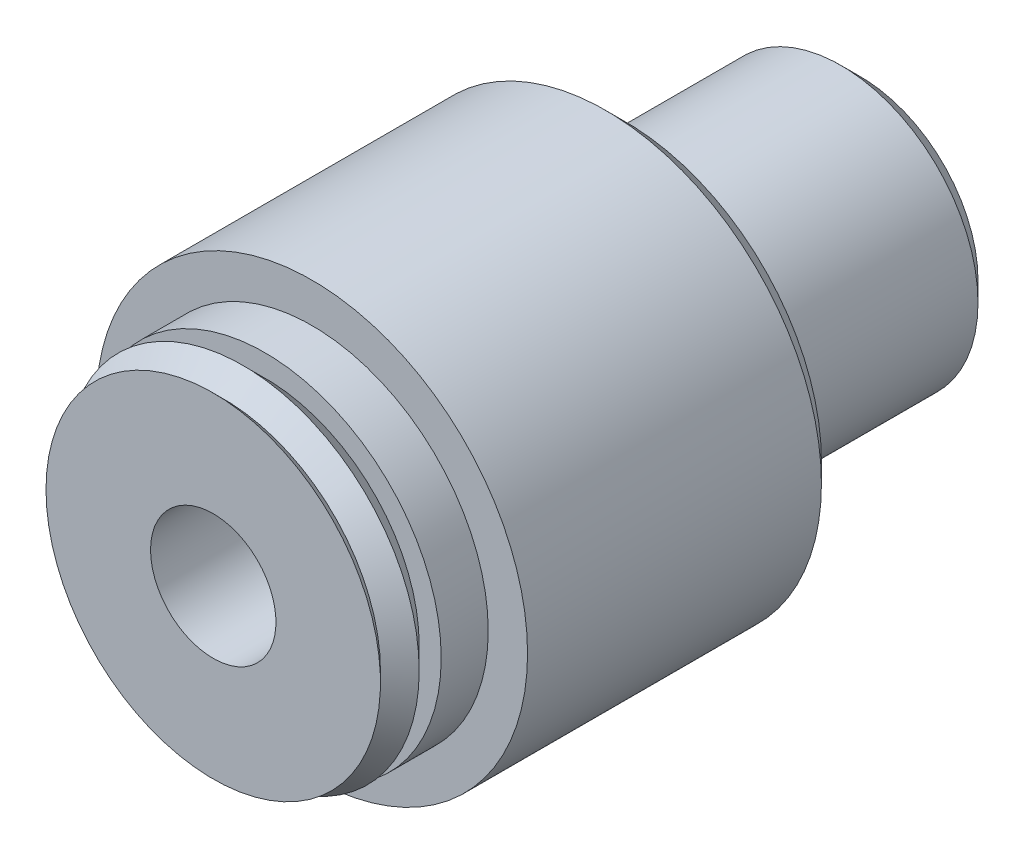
ISO-10303-21;
HEADER;
FILE_DESCRIPTION(('STEP AP214'),'2;1');
FILE_NAME('part.step','',(''),(''),'','','');
FILE_SCHEMA(('AUTOMOTIVE_DESIGN { 1 0 10303 214 1 1 1 1 }'));
ENDSEC;
DATA;
#1=APPLICATION_CONTEXT('core data for automotive mechanical design processes');
#2=APPLICATION_PROTOCOL_DEFINITION('international standard','automotive_design',2000,#1);
#3=PRODUCT_CONTEXT('',#1,'mechanical');
#4=PRODUCT('Part','Part','',(#3));
#5=PRODUCT_RELATED_PRODUCT_CATEGORY('part','',(#4));
#6=PRODUCT_DEFINITION_FORMATION('','',#4);
#7=PRODUCT_DEFINITION_CONTEXT('part definition',#1,'design');
#8=PRODUCT_DEFINITION('design','',#6,#7);
#9=PRODUCT_DEFINITION_SHAPE('','',#8);
#10=(LENGTH_UNIT() NAMED_UNIT(*) SI_UNIT(.MILLI.,.METRE.));
#11=(NAMED_UNIT(*) PLANE_ANGLE_UNIT() SI_UNIT($,.RADIAN.));
#12=(NAMED_UNIT(*) SI_UNIT($,.STERADIAN.) SOLID_ANGLE_UNIT());
#13=UNCERTAINTY_MEASURE_WITH_UNIT(LENGTH_MEASURE(1.E-05),#10,'distance_accuracy_value','');
#14=(GEOMETRIC_REPRESENTATION_CONTEXT(3) GLOBAL_UNCERTAINTY_ASSIGNED_CONTEXT((#13)) GLOBAL_UNIT_ASSIGNED_CONTEXT((#10,
#11,#12)) REPRESENTATION_CONTEXT('',''));
#15=CARTESIAN_POINT('',(0.,0.,0.));
#16=DIRECTION('',(0.,0.,1.));
#17=DIRECTION('',(1.,0.,0.));
#18=AXIS2_PLACEMENT_3D('',#15,#16,#17);
#19=CARTESIAN_POINT('',(0.,0.,0.));
#20=DIRECTION('',(0.,0.,1.));
#21=DIRECTION('',(1.,0.,0.));
#22=AXIS2_PLACEMENT_3D('',#19,#20,#21);
#23=PLANE('',#22);
#24=CARTESIAN_POINT('',(0.,0.,0.));
#25=DIRECTION('',(0.,0.,-1.));
#26=DIRECTION('',(-1.,0.,0.));
#27=AXIS2_PLACEMENT_3D('',#24,#25,#26);
#28=CIRCLE('',#27,6.77545);
#29=CARTESIAN_POINT('',(-6.77545,0.,0.));
#30=VERTEX_POINT('',#29);
#31=EDGE_CURVE('E115',#30,#30,#28,.T.);
#32=ORIENTED_EDGE('',*,*,#31,.F.);
#33=EDGE_LOOP('',(#32));
#34=FACE_BOUND('',#33,.T.);
#35=CARTESIAN_POINT('',(0.,0.,0.));
#36=DIRECTION('',(0.,0.,-1.));
#37=DIRECTION('',(-1.,0.,0.));
#38=AXIS2_PLACEMENT_3D('',#35,#36,#37);
#39=CIRCLE('',#38,2.54);
#40=CARTESIAN_POINT('',(-2.54,0.,0.));
#41=VERTEX_POINT('',#40);
#42=EDGE_CURVE('E126',#41,#41,#39,.T.);
#43=ORIENTED_EDGE('',*,*,#42,.T.);
#44=EDGE_LOOP('',(#43));
#45=FACE_BOUND('',#44,.T.);
#46=ADVANCED_FACE('F30',(#34,#45),#23,.T.);
#47=CARTESIAN_POINT('',(0.,0.,-26.223214));
#48=DIRECTION('',(0.,0.,-1.));
#49=DIRECTION('',(-1.,0.,0.));
#50=AXIS2_PLACEMENT_3D('',#47,#48,#49);
#51=PLANE('',#50);
#52=CARTESIAN_POINT('',(0.,0.,-26.223214));
#53=DIRECTION('',(0.,0.,-1.));
#54=DIRECTION('',(-1.,0.,0.));
#55=AXIS2_PLACEMENT_3D('',#52,#53,#54);
#56=CIRCLE('',#55,4.7625);
#57=CARTESIAN_POINT('',(4.7625,0.,-26.223214));
#58=VERTEX_POINT('',#57);
#59=EDGE_CURVE('E47',#58,#58,#56,.T.);
#60=ORIENTED_EDGE('',*,*,#59,.T.);
#61=EDGE_LOOP('',(#60));
#62=FACE_BOUND('',#61,.T.);
#63=CARTESIAN_POINT('',(0.,0.,-26.223214));
#64=DIRECTION('',(0.,0.,-1.));
#65=DIRECTION('',(-1.,0.,0.));
#66=AXIS2_PLACEMENT_3D('',#63,#64,#65);
#67=CIRCLE('',#66,2.54);
#68=CARTESIAN_POINT('',(-2.54,0.,-26.223214));
#69=VERTEX_POINT('',#68);
#70=EDGE_CURVE('E124',#69,#69,#67,.T.);
#71=ORIENTED_EDGE('',*,*,#70,.F.);
#72=EDGE_LOOP('',(#71));
#73=FACE_BOUND('',#72,.T.);
#74=ADVANCED_FACE('F63',(#62,#73),#51,.T.);
#75=CARTESIAN_POINT('',(-8.7376,0.,-7.173214));
#76=DIRECTION('',(1.,0.,0.));
#77=DIRECTION('',(0.,0.,-1.));
#78=AXIS2_PLACEMENT_3D('',#75,#76,#77);
#79=CYLINDRICAL_SURFACE('',#78,2.032);
#80=CARTESIAN_POINT('',(-8.7376,0.,-9.205214));
#81=CARTESIAN_POINT('',(-8.73759797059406,-0.11251614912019,-9.20521042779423));
#82=CARTESIAN_POINT('',(-8.7354047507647,-0.225074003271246,-9.1958371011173));
#83=CARTESIAN_POINT('',(-8.72686767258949,-0.446980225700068,-9.15863769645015));
#84=CARTESIAN_POINT('',(-8.72052111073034,-0.556326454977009,-9.13079959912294));
#85=CARTESIAN_POINT('',(-8.70438234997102,-0.768571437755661,-9.05759945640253));
#86=CARTESIAN_POINT('',(-8.6945939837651,-0.871477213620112,-9.0122568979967));
#87=CARTESIAN_POINT('',(-8.67262205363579,-1.06821919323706,-8.90539972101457));
#88=CARTESIAN_POINT('',(-8.66043848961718,-1.16205539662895,-8.84388510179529));
#89=CARTESIAN_POINT('',(-8.63476052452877,-1.33968569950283,-8.7052590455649));
#90=CARTESIAN_POINT('',(-8.62124813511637,-1.42329320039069,-8.62791182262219));
#91=CARTESIAN_POINT('',(-8.59455904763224,-1.57647313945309,-8.46032176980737));
#92=CARTESIAN_POINT('',(-8.58138238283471,-1.64604419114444,-8.37007766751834));
#93=CARTESIAN_POINT('',(-8.55667768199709,-1.7700227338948,-8.17784635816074));
#94=CARTESIAN_POINT('',(-8.54517260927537,-1.82422727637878,-8.07572504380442));
#95=CARTESIAN_POINT('',(-8.52537378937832,-1.91463093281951,-7.86351031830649));
#96=CARTESIAN_POINT('',(-8.51707960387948,-1.9508325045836,-7.75341799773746));
#97=CARTESIAN_POINT('',(-8.50482562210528,-2.00357737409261,-7.53042272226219));
#98=CARTESIAN_POINT('',(-8.50079258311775,-2.02045329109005,-7.4176025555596));
#99=CARTESIAN_POINT('',(-8.4972978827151,-2.03510284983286,-7.19066583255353));
#100=CARTESIAN_POINT('',(-8.49783558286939,-2.03287915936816,-7.07654945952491));
#101=CARTESIAN_POINT('',(-8.50335549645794,-2.00965931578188,-6.85276454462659));
#102=CARTESIAN_POINT('',(-8.50824523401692,-1.9890537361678,-6.74305284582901));
#103=CARTESIAN_POINT('',(-8.52177157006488,-1.93027563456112,-6.52868762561));
#104=CARTESIAN_POINT('',(-8.53040840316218,-1.89210201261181,-6.42403442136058));
#105=CARTESIAN_POINT('',(-8.55054421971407,-1.79892392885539,-6.22168063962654));
#106=CARTESIAN_POINT('',(-8.56206795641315,-1.7437729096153,-6.12405011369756));
#107=CARTESIAN_POINT('',(-8.5866644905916,-1.61830836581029,-5.93928667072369));
#108=CARTESIAN_POINT('',(-8.59973752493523,-1.54799252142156,-5.85215536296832));
#109=CARTESIAN_POINT('',(-8.62635329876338,-1.39214573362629,-5.68861933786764));
#110=CARTESIAN_POINT('',(-8.63989969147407,-1.30628371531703,-5.61253037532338));
#111=CARTESIAN_POINT('',(-8.66564488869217,-1.12286054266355,-5.47577636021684));
#112=CARTESIAN_POINT('',(-8.67784366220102,-1.02529911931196,-5.41511166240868));
#113=CARTESIAN_POINT('',(-8.69956723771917,-0.820833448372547,-5.3108342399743));
#114=CARTESIAN_POINT('',(-8.70908487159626,-0.713905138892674,-5.26726710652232));
#115=CARTESIAN_POINT('',(-8.72432110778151,-0.493973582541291,-5.19880975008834));
#116=CARTESIAN_POINT('',(-8.73004033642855,-0.380971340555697,-5.17391644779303));
#117=CARTESIAN_POINT('',(-8.73694469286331,-0.15480428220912,-5.14398241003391));
#118=CARTESIAN_POINT('',(-8.73822817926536,-0.0416993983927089,-5.13851093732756));
#119=CARTESIAN_POINT('',(-8.73639399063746,0.183808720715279,-5.14640245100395));
#120=CARTESIAN_POINT('',(-8.73327665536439,0.296212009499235,-5.15976398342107));
#121=CARTESIAN_POINT('',(-8.72305358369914,0.515669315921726,-5.20458583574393));
#122=CARTESIAN_POINT('',(-8.71599851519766,0.622772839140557,-5.23581635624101));
#123=CARTESIAN_POINT('',(-8.69869154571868,0.830218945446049,-5.31523144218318));
#124=CARTESIAN_POINT('',(-8.68843934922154,0.930560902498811,-5.36341757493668));
#125=CARTESIAN_POINT('',(-8.66563542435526,1.123388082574,-5.47624658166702));
#126=CARTESIAN_POINT('',(-8.65304991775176,1.21572409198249,-5.54113748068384));
#127=CARTESIAN_POINT('',(-8.62703722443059,1.3883502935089,-5.68521157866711));
#128=CARTESIAN_POINT('',(-8.61360991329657,1.46863869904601,-5.76439689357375));
#129=CARTESIAN_POINT('',(-8.58708097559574,1.61662481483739,-5.93679944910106));
#130=CARTESIAN_POINT('',(-8.57399212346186,1.68402246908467,-6.03027660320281));
#131=CARTESIAN_POINT('',(-8.54994125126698,1.8021675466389,-6.22747354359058));
#132=CARTESIAN_POINT('',(-8.53897913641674,1.85291571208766,-6.33119287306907));
#133=CARTESIAN_POINT('',(-8.52053551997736,1.93595940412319,-6.54536375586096));
#134=CARTESIAN_POINT('',(-8.51303376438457,1.96836256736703,-6.6557717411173));
#135=CARTESIAN_POINT('',(-8.5023300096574,2.01410032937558,-6.88066534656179));
#136=CARTESIAN_POINT('',(-8.49912721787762,2.02743844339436,-6.99515021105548));
#137=CARTESIAN_POINT('',(-8.49743852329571,2.03450298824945,-7.22191105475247));
#138=CARTESIAN_POINT('',(-8.49883782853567,2.02870668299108,-7.33417156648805));
#139=CARTESIAN_POINT('',(-8.50593357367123,1.99874469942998,-7.55606831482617));
#140=CARTESIAN_POINT('',(-8.51162994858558,1.97457929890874,-7.66570459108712));
#141=CARTESIAN_POINT('',(-8.52661852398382,1.90880893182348,-7.87880189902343));
#142=CARTESIAN_POINT('',(-8.53589461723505,1.86728201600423,-7.98228822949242));
#143=CARTESIAN_POINT('',(-8.55700187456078,1.76803152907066,-8.18089276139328));
#144=CARTESIAN_POINT('',(-8.56883334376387,1.71030602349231,-8.27600996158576));
#145=CARTESIAN_POINT('',(-8.59405451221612,1.5787511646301,-8.45750939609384));
#146=CARTESIAN_POINT('',(-8.60747352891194,1.50458544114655,-8.54364379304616));
#147=CARTESIAN_POINT('',(-8.63417061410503,1.3429261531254,-8.70240034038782));
#148=CARTESIAN_POINT('',(-8.64744864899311,1.2554294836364,-8.77501933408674));
#149=CARTESIAN_POINT('',(-8.67260607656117,1.06799924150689,-8.90574186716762));
#150=CARTESIAN_POINT('',(-8.68446134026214,0.967897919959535,-8.96360983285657));
#151=CARTESIAN_POINT('',(-8.70519060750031,0.759128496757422,-9.06160543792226));
#152=CARTESIAN_POINT('',(-8.71406695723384,0.65046722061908,-9.1017470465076));
#153=CARTESIAN_POINT('',(-8.72636889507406,0.451515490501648,-9.15650029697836));
#154=CARTESIAN_POINT('',(-8.73055328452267,0.362250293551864,-9.17473116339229));
#155=CARTESIAN_POINT('',(-8.73616958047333,0.18199909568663,-9.19908911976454));
#156=CARTESIAN_POINT('',(-8.73760164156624,0.0910131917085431,-9.20521688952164));
#157=CARTESIAN_POINT('',(-8.7376,0.,-9.205214));
#158=B_SPLINE_CURVE_WITH_KNOTS('',3,(#80,#81,#82,#83,#84,#85,#86,#87,#88,#89,#90,#91,#92,#93,
#94,#95,#96,#97,#98,#99,#100,#101,#102,#103,#104,#105,#106,#107,#108,#109,#110,#111,#112,#113,
#114,#115,#116,#117,#118,#119,#120,#121,#122,#123,#124,#125,#126,#127,#128,#129,#130,#131,#132,
#133,#134,#135,#136,#137,#138,#139,#140,#141,#142,#143,#144,#145,#146,#147,#148,#149,#150,#151,
#152,#153,#154,#155,#156,#157),.UNSPECIFIED.,.T.,.F.,(4,2,2,2,2,2,2,2,2,2,2,2,2,2,2,2,2,2,2,2,2,
2,2,2,2,2,2,2,2,2,2,2,2,2,2,2,2,2,4),(0.,0.337215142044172,0.674650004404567,1.01171029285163,
1.34877059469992,1.69127297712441,2.0338091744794,2.38067838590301,2.72750022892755,
3.06825860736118,3.40896939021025,3.74260884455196,4.07626919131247,4.41289470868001,
4.74957175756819,5.0945120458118,5.4394602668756,5.78532215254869,6.13112699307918,
6.46921292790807,6.807272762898,7.14107976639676,7.47491763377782,7.81403098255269,
8.15319457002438,8.49948578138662,8.8457615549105,9.18998397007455,9.53414290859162,
9.86978309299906,10.2054182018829,10.5395603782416,10.8737424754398,11.2155243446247,
11.5573859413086,11.9044062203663,12.2511525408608,12.5239378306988,12.7967077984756),.UNSPECIFIED.);
#159=CARTESIAN_POINT('',(-8.7376,0.,-9.205214));
#160=VERTEX_POINT('',#159);
#161=EDGE_CURVE('E10',#160,#160,#158,.T.);
#162=ORIENTED_EDGE('',*,*,#161,.T.);
#163=EDGE_LOOP('',(#162));
#164=FACE_BOUND('',#163,.T.);
#165=CARTESIAN_POINT('',(-2.54,0.,-9.205214));
#166=CARTESIAN_POINT('',(-2.53999253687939,-0.0975328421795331,-9.20520630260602));
#167=CARTESIAN_POINT('',(-2.53432433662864,-0.195207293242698,-9.19813308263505));
#168=CARTESIAN_POINT('',(-2.51215414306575,-0.38742050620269,-9.17031443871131));
#169=CARTESIAN_POINT('',(-2.49562818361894,-0.48195184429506,-9.1495387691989));
#170=CARTESIAN_POINT('',(-2.45330202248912,-0.664560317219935,-9.09581295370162));
#171=CARTESIAN_POINT('',(-2.42756098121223,-0.752674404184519,-9.06294043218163));
#172=CARTESIAN_POINT('',(-2.36866139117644,-0.921437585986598,-8.9866544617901));
#173=CARTESIAN_POINT('',(-2.33550281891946,-1.00208665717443,-8.94324097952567));
#174=CARTESIAN_POINT('',(-2.25121117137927,-1.18178991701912,-8.83068917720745));
#175=CARTESIAN_POINT('',(-2.19783944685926,-1.27747594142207,-8.75785690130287));
#176=CARTESIAN_POINT('',(-2.08575816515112,-1.45330994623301,-8.59837254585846));
#177=CARTESIAN_POINT('',(-2.02703345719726,-1.53341167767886,-8.51168068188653));
#178=CARTESIAN_POINT('',(-1.9384625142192,-1.64201152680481,-8.37170261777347));
#179=CARTESIAN_POINT('',(-1.90861768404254,-1.67651407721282,-8.32295589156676));
#180=CARTESIAN_POINT('',(-1.84969485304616,-1.74130494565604,-8.22224656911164));
#181=CARTESIAN_POINT('',(-1.82061709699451,-1.77159193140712,-8.17028296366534));
#182=CARTESIAN_POINT('',(-1.76428576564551,-1.82769570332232,-8.06326574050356));
#183=CARTESIAN_POINT('',(-1.73702737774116,-1.85352459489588,-8.00822104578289));
#184=CARTESIAN_POINT('',(-1.68548040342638,-1.90051862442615,-7.89488788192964));
#185=CARTESIAN_POINT('',(-1.66118928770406,-1.92168774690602,-7.83660223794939));
#186=CARTESIAN_POINT('',(-1.61376464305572,-1.96175087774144,-7.70777699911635));
#187=CARTESIAN_POINT('',(-1.59134637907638,-1.9798323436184,-7.63670770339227));
#188=CARTESIAN_POINT('',(-1.55519156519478,-2.00836259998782,-7.49099949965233));
#189=CARTESIAN_POINT('',(-1.54143368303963,-2.01883015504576,-7.41636985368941));
#190=CARTESIAN_POINT('',(-1.52485541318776,-2.03138853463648,-7.26446014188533));
#191=CARTESIAN_POINT('',(-1.52213143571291,-2.03340552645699,-7.18716264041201));
#192=CARTESIAN_POINT('',(-1.52847012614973,-2.02864199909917,-7.03330536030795));
#193=CARTESIAN_POINT('',(-1.53754276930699,-2.02185403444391,-6.95674626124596));
#194=CARTESIAN_POINT('',(-1.56789849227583,-1.99842425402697,-6.79503629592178));
#195=CARTESIAN_POINT('',(-1.59087150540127,-1.98040556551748,-6.71041790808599));
#196=CARTESIAN_POINT('',(-1.64589420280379,-1.93491660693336,-6.54681382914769));
#197=CARTESIAN_POINT('',(-1.67797072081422,-1.90741834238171,-6.46784566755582));
#198=CARTESIAN_POINT('',(-1.7643461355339,-1.828536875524,-6.27846132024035));
#199=CARTESIAN_POINT('',(-1.82182386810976,-1.77205524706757,-6.17163846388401));
#200=CARTESIAN_POINT('',(-1.93968400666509,-1.6422468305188,-5.97055784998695));
#201=CARTESIAN_POINT('',(-2.00007054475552,-1.56889548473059,-5.87631873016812));
#202=CARTESIAN_POINT('',(-2.11950555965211,-1.40356151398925,-5.69871883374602));
#203=CARTESIAN_POINT('',(-2.17847559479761,-1.31113480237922,-5.61571452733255));
#204=CARTESIAN_POINT('',(-2.2877462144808,-1.10945666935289,-5.4662329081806));
#205=CARTESIAN_POINT('',(-2.33806991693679,-1.00025163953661,-5.39971130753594));
#206=CARTESIAN_POINT('',(-2.41223379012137,-0.80038225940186,-5.30320214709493));
#207=CARTESIAN_POINT('',(-2.43952848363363,-0.713412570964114,-5.26820942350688));
#208=CARTESIAN_POINT('',(-2.48511125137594,-0.533312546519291,-5.21017352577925));
#209=CARTESIAN_POINT('',(-2.50340611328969,-0.440186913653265,-5.18712134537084));
#210=CARTESIAN_POINT('',(-2.52953861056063,-0.249644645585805,-5.15428123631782));
#211=CARTESIAN_POINT('',(-2.53732160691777,-0.152208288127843,-5.14456260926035));
#212=CARTESIAN_POINT('',(-2.54151061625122,0.0432897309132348,-5.13932520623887));
#213=CARTESIAN_POINT('',(-2.53791874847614,0.141351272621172,-5.14380378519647));
#214=CARTESIAN_POINT('',(-2.52046088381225,0.326894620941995,-5.16568214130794));
#215=CARTESIAN_POINT('',(-2.50745094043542,0.414589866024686,-5.18200556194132));
#216=CARTESIAN_POINT('',(-2.4731219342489,0.585557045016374,-5.22541213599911));
#217=CARTESIAN_POINT('',(-2.45180040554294,0.668827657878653,-5.25249848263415));
#218=CARTESIAN_POINT('',(-2.40070487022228,0.834375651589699,-5.3181507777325));
#219=CARTESIAN_POINT('',(-2.37048967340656,0.916273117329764,-5.35732307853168));
#220=CARTESIAN_POINT('',(-2.30412160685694,1.07229656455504,-5.44485794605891));
#221=CARTESIAN_POINT('',(-2.26796844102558,1.14642215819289,-5.4932209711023));
#222=CARTESIAN_POINT('',(-2.18433586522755,1.2997204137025,-5.60778590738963));
#223=CARTESIAN_POINT('',(-2.13600761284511,1.37719530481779,-5.67563171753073));
#224=CARTESIAN_POINT('',(-2.03650593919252,1.52048146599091,-5.82131115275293));
#225=CARTESIAN_POINT('',(-1.98532466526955,1.58625822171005,-5.89917320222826));
#226=CARTESIAN_POINT('',(-1.90372121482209,1.6821758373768,-6.03167139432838));
#227=CARTESIAN_POINT('',(-1.8730441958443,1.71616361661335,-6.08341236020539));
#228=CARTESIAN_POINT('',(-1.81290382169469,1.77957481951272,-6.19035821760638));
#229=CARTESIAN_POINT('',(-1.78344111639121,1.80899582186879,-6.24556492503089));
#230=CARTESIAN_POINT('',(-1.72703570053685,1.86291819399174,-6.35927083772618));
#231=CARTESIAN_POINT('',(-1.70008388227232,1.88743774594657,-6.41775680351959));
#232=CARTESIAN_POINT('',(-1.65008773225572,1.93129897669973,-6.53822312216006));
#233=CARTESIAN_POINT('',(-1.62704058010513,1.95064439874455,-6.60020090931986));
#234=CARTESIAN_POINT('',(-1.58515730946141,1.98485928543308,-6.73235811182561));
#235=CARTESIAN_POINT('',(-1.56677072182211,1.99928032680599,-6.8028034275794));
#236=CARTESIAN_POINT('',(-1.53917265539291,2.02060968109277,-6.94648101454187));
#237=CARTESIAN_POINT('',(-1.52993803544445,2.02753694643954,-7.0197057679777));
#238=CARTESIAN_POINT('',(-1.52221932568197,2.03334171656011,-7.16747228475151));
#239=CARTESIAN_POINT('',(-1.52379299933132,2.03217596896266,-7.24201899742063));
#240=CARTESIAN_POINT('',(-1.53752064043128,2.02180463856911,-7.38960594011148));
#241=CARTESIAN_POINT('',(-1.54969138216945,2.01258630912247,-7.46264359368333));
#242=CARTESIAN_POINT('',(-1.58706389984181,1.98331069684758,-7.62493448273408));
#243=CARTESIAN_POINT('',(-1.61492446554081,1.96097378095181,-7.71313985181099));
#244=CARTESIAN_POINT('',(-1.67933530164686,1.9060990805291,-7.88302561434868));
#245=CARTESIAN_POINT('',(-1.71591109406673,1.87353124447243,-7.9646858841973));
#246=CARTESIAN_POINT('',(-1.7829901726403,1.80944262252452,-8.09998656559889));
#247=CARTESIAN_POINT('',(-1.81243129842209,1.7800560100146,-8.15519748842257));
#248=CARTESIAN_POINT('',(-1.87256875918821,1.71668169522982,-8.26220164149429));
#249=CARTESIAN_POINT('',(-1.90326554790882,1.68269231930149,-8.31399361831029));
#250=CARTESIAN_POINT('',(-1.9958100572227,1.5739713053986,-8.46432587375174));
#251=CARTESIAN_POINT('',(-2.05810925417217,1.4924891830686,-8.55781746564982));
#252=CARTESIAN_POINT('',(-2.17848971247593,1.3106574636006,-8.73113769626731));
#253=CARTESIAN_POINT('',(-2.23650547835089,1.21007597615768,-8.81077254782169));
#254=CARTESIAN_POINT('',(-2.31520645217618,1.04646374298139,-8.91623995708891));
#255=CARTESIAN_POINT('',(-2.34003969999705,0.989843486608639,-8.94904833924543));
#256=CARTESIAN_POINT('',(-2.38623973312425,0.872596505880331,-9.00949999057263));
#257=CARTESIAN_POINT('',(-2.40760863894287,0.811972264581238,-9.03714642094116));
#258=CARTESIAN_POINT('',(-2.45283640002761,0.66551834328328,-9.09526254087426));
#259=CARTESIAN_POINT('',(-2.47500539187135,0.578216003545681,-9.12340839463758));
#260=CARTESIAN_POINT('',(-2.51011806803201,0.398996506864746,-9.16778219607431));
#261=CARTESIAN_POINT('',(-2.52308591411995,0.307092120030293,-9.18404136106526));
#262=CARTESIAN_POINT('',(-2.53395864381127,0.178695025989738,-9.19765803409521));
#263=CARTESIAN_POINT('',(-2.53621965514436,0.14306149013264,-9.200486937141));
#264=CARTESIAN_POINT('',(-2.53924187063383,0.071625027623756,-9.20426654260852));
#265=CARTESIAN_POINT('',(-2.54000274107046,0.0358220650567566,-9.20521682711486));
#266=CARTESIAN_POINT('',(-2.54,0.,-9.205214));
#267=B_SPLINE_CURVE_WITH_KNOTS('',3,(#165,#166,#167,#168,#169,#170,#171,#172,#173,#174,#175,
#176,#177,#178,#179,#180,#181,#182,#183,#184,#185,#186,#187,#188,#189,#190,#191,#192,#193,#194,
#195,#196,#197,#198,#199,#200,#201,#202,#203,#204,#205,#206,#207,#208,#209,#210,#211,#212,#213,
#214,#215,#216,#217,#218,#219,#220,#221,#222,#223,#224,#225,#226,#227,#228,#229,#230,#231,#232,
#233,#234,#235,#236,#237,#238,#239,#240,#241,#242,#243,#244,#245,#246,#247,#248,#249,#250,#251,
#252,#253,#254,#255,#256,#257,#258,#259,#260,#261,#262,#263,#264,#265,#266),.UNSPECIFIED.,.T.,
.F.,(4,2,2,2,2,2,2,2,2,2,2,2,2,2,2,2,2,2,2,2,2,2,2,2,2,2,2,2,2,2,2,2,2,2,2,2,2,2,2,2,2,2,2,2,2,
2,2,2,2,2,4),(0.,0.292441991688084,0.585531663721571,0.876772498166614,1.16801425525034,
1.56065614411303,1.95444605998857,2.15456662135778,2.35475028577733,2.55438151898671,
2.75384138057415,2.98310374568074,3.21179915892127,3.44248857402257,3.67337318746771,
3.94042104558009,4.20826438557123,4.607598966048,5.00751858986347,5.4180868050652,
5.82753958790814,6.11928738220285,6.41081480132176,6.7038517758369,6.99683415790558,
7.26607733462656,7.53540045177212,7.82137973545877,8.10737328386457,8.447467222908,
8.78854850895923,8.99560962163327,9.2027801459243,9.40916728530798,9.61540470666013,
9.83721904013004,10.0584710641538,10.2809064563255,10.5036945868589,10.7875973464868,
11.072341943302,11.2794743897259,11.486682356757,11.9011165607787,12.3209479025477,
12.5305941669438,12.7401116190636,13.0220059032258,13.303157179,13.4105419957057,
13.5179506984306),.UNSPECIFIED.);
#268=CARTESIAN_POINT('',(-2.54,0.,-9.205214));
#269=VERTEX_POINT('',#268);
#270=EDGE_CURVE('E34',#269,#269,#267,.T.);
#271=ORIENTED_EDGE('',*,*,#270,.F.);
#272=EDGE_LOOP('',(#271));
#273=FACE_BOUND('',#272,.T.);
#274=ADVANCED_FACE('F58',(#164,#273),#79,.F.);
#275=CARTESIAN_POINT('',(0.,0.,-16.698214));
#276=DIRECTION('',(0.,0.,1.));
#277=DIRECTION('',(1.,0.,0.));
#278=AXIS2_PLACEMENT_3D('',#275,#276,#277);
#279=PLANE('',#278);
#280=CARTESIAN_POINT('',(0.,0.,-16.698214));
#281=DIRECTION('',(0.,0.,1.));
#282=DIRECTION('',(1.,0.,0.));
#283=AXIS2_PLACEMENT_3D('',#280,#281,#282);
#284=CIRCLE('',#283,7.94385);
#285=CARTESIAN_POINT('',(7.94385,0.,-16.698214));
#286=VERTEX_POINT('',#285);
#287=EDGE_CURVE('E106',#286,#286,#284,.F.);
#288=ORIENTED_EDGE('',*,*,#287,.T.);
#289=EDGE_LOOP('',(#288));
#290=FACE_BOUND('',#289,.T.);
#291=CARTESIAN_POINT('',(0.,0.,-16.698214));
#292=DIRECTION('',(0.,0.,1.));
#293=DIRECTION('',(1.,0.,0.));
#294=AXIS2_PLACEMENT_3D('',#291,#292,#293);
#295=CIRCLE('',#294,5.55625);
#296=CARTESIAN_POINT('',(5.55625,0.,-16.698214));
#297=VERTEX_POINT('',#296);
#298=EDGE_CURVE('E111',#297,#297,#295,.F.);
#299=ORIENTED_EDGE('',*,*,#298,.F.);
#300=EDGE_LOOP('',(#299));
#301=FACE_BOUND('',#300,.T.);
#302=ADVANCED_FACE('F62',(#290,#301),#279,.F.);
#303=CARTESIAN_POINT('',(0.,0.,-0.416559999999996));
#304=DIRECTION('',(0.,0.,1.));
#305=DIRECTION('',(1.,0.,0.));
#306=AXIS2_PLACEMENT_3D('',#303,#304,#305);
#307=CONICAL_SURFACE('',#306,6.35889,0.785398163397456);
#308=ORIENTED_EDGE('',*,*,#31,.T.);
#309=EDGE_LOOP('',(#308));
#310=FACE_BOUND('',#309,.T.);
#311=CARTESIAN_POINT('',(0.,0.,-0.416559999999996));
#312=DIRECTION('',(0.,0.,-1.));
#313=DIRECTION('',(-1.,0.,0.));
#314=AXIS2_PLACEMENT_3D('',#311,#312,#313);
#315=CIRCLE('',#314,6.35889);
#316=CARTESIAN_POINT('',(-6.35889,0.,-0.416559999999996));
#317=VERTEX_POINT('',#316);
#318=EDGE_CURVE('E146',#317,#317,#315,.T.);
#319=ORIENTED_EDGE('',*,*,#318,.F.);
#320=EDGE_LOOP('',(#319));
#321=FACE_BOUND('',#320,.T.);
#322=ADVANCED_FACE('F77',(#310,#321),#307,.T.);
#323=CARTESIAN_POINT('',(0.,0.,-1.20141999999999));
#324=DIRECTION('',(0.,0.,-1.));
#325=DIRECTION('',(-1.,0.,0.));
#326=AXIS2_PLACEMENT_3D('',#323,#324,#325);
#327=CONICAL_SURFACE('',#326,7.14374999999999,0.785398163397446);
#328=ORIENTED_EDGE('',*,*,#318,.T.);
#329=EDGE_LOOP('',(#328));
#330=FACE_BOUND('',#329,.T.);
#331=CARTESIAN_POINT('',(0.,0.,-1.20141999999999));
#332=DIRECTION('',(0.,0.,-1.));
#333=DIRECTION('',(-1.,0.,0.));
#334=AXIS2_PLACEMENT_3D('',#331,#332,#333);
#335=CIRCLE('',#334,7.14374999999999);
#336=CARTESIAN_POINT('',(-7.14374999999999,0.,-1.20141999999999));
#337=VERTEX_POINT('',#336);
#338=EDGE_CURVE('E143',#337,#337,#335,.T.);
#339=ORIENTED_EDGE('',*,*,#338,.F.);
#340=EDGE_LOOP('',(#339));
#341=FACE_BOUND('',#340,.T.);
#342=ADVANCED_FACE('F152',(#330,#341),#327,.T.);
#343=CARTESIAN_POINT('',(0.,0.,-2.093214));
#344=DIRECTION('',(0.,0.,1.));
#345=DIRECTION('',(1.,0.,0.));
#346=AXIS2_PLACEMENT_3D('',#343,#344,#345);
#347=CONICAL_SURFACE('',#346,6.25195599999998,0.785398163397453);
#348=ORIENTED_EDGE('',*,*,#338,.T.);
#349=EDGE_LOOP('',(#348));
#350=FACE_BOUND('',#349,.T.);
#351=CARTESIAN_POINT('',(0.,0.,-2.093214));
#352=DIRECTION('',(0.,0.,-1.));
#353=DIRECTION('',(-1.,0.,0.));
#354=AXIS2_PLACEMENT_3D('',#351,#352,#353);
#355=CIRCLE('',#354,6.25195599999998);
#356=CARTESIAN_POINT('',(-6.25195599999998,0.,-2.093214));
#357=VERTEX_POINT('',#356);
#358=EDGE_CURVE('E140',#357,#357,#355,.T.);
#359=ORIENTED_EDGE('',*,*,#358,.F.);
#360=EDGE_LOOP('',(#359));
#361=FACE_BOUND('',#360,.T.);
#362=ADVANCED_FACE('F157',(#350,#361),#347,.T.);
#363=CARTESIAN_POINT('',(0.,6.25195599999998,-2.093214));
#364=DIRECTION('',(0.,0.,1.));
#365=DIRECTION('',(1.,0.,0.));
#366=AXIS2_PLACEMENT_3D('',#363,#364,#365);
#367=PLANE('',#366);
#368=ORIENTED_EDGE('',*,*,#358,.T.);
#369=EDGE_LOOP('',(#368));
#370=FACE_BOUND('',#369,.T.);
#371=CARTESIAN_POINT('',(0.,0.,-2.093214));
#372=DIRECTION('',(0.,0.,-1.));
#373=DIRECTION('',(-1.,0.,0.));
#374=AXIS2_PLACEMENT_3D('',#371,#372,#373);
#375=CIRCLE('',#374,7.14374999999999);
#376=CARTESIAN_POINT('',(-7.14374999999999,0.,-2.093214));
#377=VERTEX_POINT('',#376);
#378=EDGE_CURVE('E137',#377,#377,#375,.T.);
#379=ORIENTED_EDGE('',*,*,#378,.F.);
#380=EDGE_LOOP('',(#379));
#381=FACE_BOUND('',#380,.T.);
#382=ADVANCED_FACE('F162',(#370,#381),#367,.T.);
#383=CARTESIAN_POINT('',(0.,0.,-71.2941240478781));
#384=DIRECTION('',(0.,0.,-1.));
#385=DIRECTION('',(-1.,0.,0.));
#386=AXIS2_PLACEMENT_3D('',#383,#384,#385);
#387=CYLINDRICAL_SURFACE('',#386,7.14374999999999);
#388=ORIENTED_EDGE('',*,*,#378,.T.);
#389=EDGE_LOOP('',(#388));
#390=FACE_BOUND('',#389,.T.);
#391=CARTESIAN_POINT('',(0.,0.,-3.998214));
#392=DIRECTION('',(0.,0.,-1.));
#393=DIRECTION('',(-1.,0.,0.));
#394=AXIS2_PLACEMENT_3D('',#391,#392,#393);
#395=CIRCLE('',#394,7.14374999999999);
#396=CARTESIAN_POINT('',(-7.14374999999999,0.,-3.998214));
#397=VERTEX_POINT('',#396);
#398=EDGE_CURVE('E135',#397,#397,#395,.T.);
#399=ORIENTED_EDGE('',*,*,#398,.F.);
#400=EDGE_LOOP('',(#399));
#401=FACE_BOUND('',#400,.T.);
#402=ADVANCED_FACE('F84',(#390,#401),#387,.T.);
#403=CARTESIAN_POINT('',(0.,0.,-16.698214));
#404=DIRECTION('',(0.,0.,1.));
#405=DIRECTION('',(1.,0.,0.));
#406=AXIS2_PLACEMENT_3D('',#403,#404,#405);
#407=CYLINDRICAL_SURFACE('',#406,8.7376);
#408=ORIENTED_EDGE('',*,*,#161,.F.);
#409=EDGE_LOOP('',(#408));
#410=FACE_BOUND('',#409,.T.);
#411=CARTESIAN_POINT('',(0.,0.,-15.904464));
#412=DIRECTION('',(0.,0.,1.));
#413=DIRECTION('',(1.,0.,0.));
#414=AXIS2_PLACEMENT_3D('',#411,#412,#413);
#415=CIRCLE('',#414,8.7376);
#416=CARTESIAN_POINT('',(8.7376,0.,-15.904464));
#417=VERTEX_POINT('',#416);
#418=EDGE_CURVE('E109',#417,#417,#415,.T.);
#419=ORIENTED_EDGE('',*,*,#418,.T.);
#420=EDGE_LOOP('',(#419));
#421=FACE_BOUND('',#420,.T.);
#422=CARTESIAN_POINT('',(0.,0.,-3.998214));
#423=DIRECTION('',(0.,0.,1.));
#424=DIRECTION('',(1.,0.,0.));
#425=AXIS2_PLACEMENT_3D('',#422,#423,#424);
#426=CIRCLE('',#425,8.7376);
#427=CARTESIAN_POINT('',(8.7376,0.,-3.998214));
#428=VERTEX_POINT('',#427);
#429=EDGE_CURVE('E129',#428,#428,#426,.T.);
#430=ORIENTED_EDGE('',*,*,#429,.F.);
#431=EDGE_LOOP('',(#430));
#432=FACE_BOUND('',#431,.T.);
#433=ADVANCED_FACE('F54',(#410,#421,#432),#407,.T.);
#434=CARTESIAN_POINT('',(0.,0.,-3.998214));
#435=DIRECTION('',(0.,0.,1.));
#436=DIRECTION('',(1.,0.,0.));
#437=AXIS2_PLACEMENT_3D('',#434,#435,#436);
#438=PLANE('',#437);
#439=ORIENTED_EDGE('',*,*,#398,.T.);
#440=EDGE_LOOP('',(#439));
#441=FACE_BOUND('',#440,.T.);
#442=ORIENTED_EDGE('',*,*,#429,.T.);
#443=EDGE_LOOP('',(#442));
#444=FACE_BOUND('',#443,.T.);
#445=ADVANCED_FACE('F74',(#441,#444),#438,.T.);
#446=CARTESIAN_POINT('',(0.,0.,-26.223214));
#447=DIRECTION('',(0.,0.,1.));
#448=DIRECTION('',(1.,0.,0.));
#449=AXIS2_PLACEMENT_3D('',#446,#447,#448);
#450=CYLINDRICAL_SURFACE('',#449,5.55625);
#451=CARTESIAN_POINT('',(0.,0.,-25.429464));
#452=DIRECTION('',(0.,0.,-1.));
#453=DIRECTION('',(-1.,0.,0.));
#454=AXIS2_PLACEMENT_3D('',#451,#452,#453);
#455=CIRCLE('',#454,5.55625);
#456=CARTESIAN_POINT('',(5.55625,0.,-25.429464));
#457=VERTEX_POINT('',#456);
#458=EDGE_CURVE('E43',#457,#457,#455,.F.);
#459=CARTESIAN_POINT('',(5.55625,0.,-25.429464));
#460=CARTESIAN_POINT('',(5.55625,0.,-25.3385134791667));
#461=CARTESIAN_POINT('',(5.55625,0.,-25.2475629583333));
#462=CARTESIAN_POINT('',(5.55625,0.,-25.0656619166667));
#463=CARTESIAN_POINT('',(5.55625,0.,-24.9747113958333));
#464=CARTESIAN_POINT('',(5.55625,0.,-24.7928103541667));
#465=CARTESIAN_POINT('',(5.55625,0.,-24.7018598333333));
#466=CARTESIAN_POINT('',(5.55625,0.,-24.5199587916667));
#467=CARTESIAN_POINT('',(5.55625,0.,-24.4290082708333));
#468=CARTESIAN_POINT('',(5.55625,0.,-24.2471072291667));
#469=CARTESIAN_POINT('',(5.55625,0.,-24.1561567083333));
#470=CARTESIAN_POINT('',(5.55625,0.,-23.9742556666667));
#471=CARTESIAN_POINT('',(5.55625,0.,-23.8833051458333));
#472=CARTESIAN_POINT('',(5.55625,0.,-23.7014041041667));
#473=CARTESIAN_POINT('',(5.55625,0.,-23.6104535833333));
#474=CARTESIAN_POINT('',(5.55625,0.,-23.4285525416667));
#475=CARTESIAN_POINT('',(5.55625,0.,-23.3376020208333));
#476=CARTESIAN_POINT('',(5.55625,0.,-23.1557009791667));
#477=CARTESIAN_POINT('',(5.55625,0.,-23.0647504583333));
#478=CARTESIAN_POINT('',(5.55625,0.,-22.8828494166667));
#479=CARTESIAN_POINT('',(5.55625,0.,-22.7918988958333));
#480=CARTESIAN_POINT('',(5.55625,0.,-22.6099978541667));
#481=CARTESIAN_POINT('',(5.55625,0.,-22.5190473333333));
#482=CARTESIAN_POINT('',(5.55625,0.,-22.3371462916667));
#483=CARTESIAN_POINT('',(5.55625,0.,-22.2461957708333));
#484=CARTESIAN_POINT('',(5.55625,0.,-22.0642947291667));
#485=CARTESIAN_POINT('',(5.55625,0.,-21.9733442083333));
#486=CARTESIAN_POINT('',(5.55625,0.,-21.7914431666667));
#487=CARTESIAN_POINT('',(5.55625,0.,-21.7004926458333));
#488=CARTESIAN_POINT('',(5.55625,0.,-21.5185916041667));
#489=CARTESIAN_POINT('',(5.55625,0.,-21.4276410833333));
#490=CARTESIAN_POINT('',(5.55625,0.,-21.2457400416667));
#491=CARTESIAN_POINT('',(5.55625,0.,-21.1547895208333));
#492=CARTESIAN_POINT('',(5.55625,0.,-20.9728884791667));
#493=CARTESIAN_POINT('',(5.55625,0.,-20.8819379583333));
#494=CARTESIAN_POINT('',(5.55625,0.,-20.7000369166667));
#495=CARTESIAN_POINT('',(5.55625,0.,-20.6090863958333));
#496=CARTESIAN_POINT('',(5.55625,0.,-20.4271853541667));
#497=CARTESIAN_POINT('',(5.55625,0.,-20.3362348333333));
#498=CARTESIAN_POINT('',(5.55625,0.,-20.1543337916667));
#499=CARTESIAN_POINT('',(5.55625,0.,-20.0633832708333));
#500=CARTESIAN_POINT('',(5.55625,0.,-19.8814822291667));
#501=CARTESIAN_POINT('',(5.55625,0.,-19.7905317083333));
#502=CARTESIAN_POINT('',(5.55625,0.,-19.6086306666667));
#503=CARTESIAN_POINT('',(5.55625,0.,-19.5176801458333));
#504=CARTESIAN_POINT('',(5.55625,0.,-19.3357791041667));
#505=CARTESIAN_POINT('',(5.55625,0.,-19.2448285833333));
#506=CARTESIAN_POINT('',(5.55625,0.,-19.0629275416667));
#507=CARTESIAN_POINT('',(5.55625,0.,-18.9719770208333));
#508=CARTESIAN_POINT('',(5.55625,0.,-18.7900759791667));
#509=CARTESIAN_POINT('',(5.55625,0.,-18.6991254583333));
#510=CARTESIAN_POINT('',(5.55625,0.,-18.5172244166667));
#511=CARTESIAN_POINT('',(5.55625,0.,-18.4262738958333));
#512=CARTESIAN_POINT('',(5.55625,0.,-18.2443728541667));
#513=CARTESIAN_POINT('',(5.55625,0.,-18.1534223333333));
#514=CARTESIAN_POINT('',(5.55625,0.,-17.9715212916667));
#515=CARTESIAN_POINT('',(5.55625,0.,-17.8805707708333));
#516=CARTESIAN_POINT('',(5.55625,0.,-17.6986697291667));
#517=CARTESIAN_POINT('',(5.55625,0.,-17.6077192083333));
#518=CARTESIAN_POINT('',(5.55625,0.,-17.4258181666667));
#519=CARTESIAN_POINT('',(5.55625,0.,-17.3348676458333));
#520=CARTESIAN_POINT('',(5.55625,0.,-17.1529666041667));
#521=CARTESIAN_POINT('',(5.55625,0.,-17.0620160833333));
#522=CARTESIAN_POINT('',(5.55625,0.,-16.8801150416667));
#523=CARTESIAN_POINT('',(5.55625,0.,-16.7891645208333));
#524=CARTESIAN_POINT('',(5.55625,0.,-16.698214));
#525=B_SPLINE_CURVE_WITH_KNOTS('',3,(#459,#460,#461,#462,#463,#464,#465,#466,#467,#468,#469,
#470,#471,#472,#473,#474,#475,#476,#477,#478,#479,#480,#481,#482,#483,#484,#485,#486,#487,#488,
#489,#490,#491,#492,#493,#494,#495,#496,#497,#498,#499,#500,#501,#502,#503,#504,#505,#506,#507,
#508,#509,#510,#511,#512,#513,#514,#515,#516,#517,#518,#519,#520,#521,#522,#523,#524),
.UNSPECIFIED.,.F.,.F.,(4,2,2,2,2,2,2,2,2,2,2,2,2,2,2,2,2,2,2,2,2,2,2,2,2,2,2,2,2,2,2,2,4),(0.,
0.272851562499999,0.545703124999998,0.818554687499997,1.09140625,1.3642578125,1.637109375,
1.9099609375,2.1828125,2.4556640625,2.728515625,3.0013671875,3.27421875,3.5470703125,
3.819921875,4.0927734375,4.36562499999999,4.6384765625,4.911328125,5.1841796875,5.45703125,
5.7298828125,6.002734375,6.27558593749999,6.5484375,6.8212890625,7.094140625,7.36699218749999,
7.63984375,7.91269531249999,8.18554687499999,8.45839843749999,8.73124999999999),.UNSPECIFIED.);
#526=EDGE_CURVE('BSEAM70',#457,#297,#525,.T.);
#527=ORIENTED_EDGE('',*,*,#458,.T.);
#528=ORIENTED_EDGE('',*,*,#298,.T.);
#529=ORIENTED_EDGE('',*,*,#526,.T.);
#530=ORIENTED_EDGE('',*,*,#526,.F.);
#531=EDGE_LOOP('',(#527,#529,#528,#530));
#532=FACE_BOUND('',#531,.T.);
#533=ADVANCED_FACE('F70',(#532),#450,.T.);
#534=CARTESIAN_POINT('',(0.,0.,-15.904464));
#535=DIRECTION('',(0.,0.,1.));
#536=DIRECTION('',(1.,0.,0.));
#537=AXIS2_PLACEMENT_3D('',#534,#535,#536);
#538=CONICAL_SURFACE('',#537,8.7376,0.78539816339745);
#539=ORIENTED_EDGE('',*,*,#287,.F.);
#540=EDGE_LOOP('',(#539));
#541=FACE_BOUND('',#540,.T.);
#542=ORIENTED_EDGE('',*,*,#418,.F.);
#543=EDGE_LOOP('',(#542));
#544=FACE_BOUND('',#543,.T.);
#545=ADVANCED_FACE('F73',(#541,#544),#538,.T.);
#546=CARTESIAN_POINT('',(0.,0.,-26.223214));
#547=DIRECTION('',(0.,0.,1.));
#548=DIRECTION('',(1.,0.,0.));
#549=AXIS2_PLACEMENT_3D('',#546,#547,#548);
#550=CONICAL_SURFACE('',#549,4.7625,0.785398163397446);
#551=CARTESIAN_POINT('',(5.55625,0.,-25.429464));
#552=CARTESIAN_POINT('',(5.54798177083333,0.,-25.4377322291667));
#553=CARTESIAN_POINT('',(5.53971354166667,0.,-25.4460004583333));
#554=CARTESIAN_POINT('',(5.52317708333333,0.,-25.4625369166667));
#555=CARTESIAN_POINT('',(5.51490885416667,0.,-25.4708051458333));
#556=CARTESIAN_POINT('',(5.49837239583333,0.,-25.4873416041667));
#557=CARTESIAN_POINT('',(5.49010416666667,0.,-25.4956098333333));
#558=CARTESIAN_POINT('',(5.47356770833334,0.,-25.5121462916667));
#559=CARTESIAN_POINT('',(5.46529947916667,0.,-25.5204145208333));
#560=CARTESIAN_POINT('',(5.44876302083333,0.,-25.5369509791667));
#561=CARTESIAN_POINT('',(5.44049479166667,0.,-25.5452192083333));
#562=CARTESIAN_POINT('',(5.42395833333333,0.,-25.5617556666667));
#563=CARTESIAN_POINT('',(5.41569010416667,0.,-25.5700238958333));
#564=CARTESIAN_POINT('',(5.39915364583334,0.,-25.5865603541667));
#565=CARTESIAN_POINT('',(5.39088541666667,0.,-25.5948285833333));
#566=CARTESIAN_POINT('',(5.37434895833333,0.,-25.6113650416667));
#567=CARTESIAN_POINT('',(5.36608072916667,0.,-25.6196332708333));
#568=CARTESIAN_POINT('',(5.34954427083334,0.,-25.6361697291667));
#569=CARTESIAN_POINT('',(5.34127604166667,0.,-25.6444379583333));
#570=CARTESIAN_POINT('',(5.32473958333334,0.,-25.6609744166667));
#571=CARTESIAN_POINT('',(5.31647135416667,0.,-25.6692426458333));
#572=CARTESIAN_POINT('',(5.29993489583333,0.,-25.6857791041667));
#573=CARTESIAN_POINT('',(5.29166666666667,0.,-25.6940473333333));
#574=CARTESIAN_POINT('',(5.27513020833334,0.,-25.7105837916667));
#575=CARTESIAN_POINT('',(5.26686197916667,0.,-25.7188520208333));
#576=CARTESIAN_POINT('',(5.25032552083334,0.,-25.7353884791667));
#577=CARTESIAN_POINT('',(5.24205729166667,0.,-25.7436567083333));
#578=CARTESIAN_POINT('',(5.22552083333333,0.,-25.7601931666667));
#579=CARTESIAN_POINT('',(5.21725260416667,0.,-25.7684613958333));
#580=CARTESIAN_POINT('',(5.20071614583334,0.,-25.7849978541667));
#581=CARTESIAN_POINT('',(5.19244791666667,0.,-25.7932660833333));
#582=CARTESIAN_POINT('',(5.17591145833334,0.,-25.8098025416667));
#583=CARTESIAN_POINT('',(5.16764322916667,0.,-25.8180707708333));
#584=CARTESIAN_POINT('',(5.15110677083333,0.,-25.8346072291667));
#585=CARTESIAN_POINT('',(5.14283854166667,0.,-25.8428754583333));
#586=CARTESIAN_POINT('',(5.12630208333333,0.,-25.8594119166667));
#587=CARTESIAN_POINT('',(5.11803385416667,0.,-25.8676801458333));
#588=CARTESIAN_POINT('',(5.10149739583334,0.,-25.8842166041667));
#589=CARTESIAN_POINT('',(5.09322916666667,0.,-25.8924848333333));
#590=CARTESIAN_POINT('',(5.07669270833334,0.,-25.9090212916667));
#591=CARTESIAN_POINT('',(5.06842447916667,0.,-25.9172895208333));
#592=CARTESIAN_POINT('',(5.05188802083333,0.,-25.9338259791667));
#593=CARTESIAN_POINT('',(5.04361979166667,0.,-25.9420942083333));
#594=CARTESIAN_POINT('',(5.02708333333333,0.,-25.9586306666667));
#595=CARTESIAN_POINT('',(5.01881510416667,0.,-25.9668988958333));
#596=CARTESIAN_POINT('',(5.00227864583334,0.,-25.9834353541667));
#597=CARTESIAN_POINT('',(4.99401041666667,0.,-25.9917035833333));
#598=CARTESIAN_POINT('',(4.97747395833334,0.,-26.0082400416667));
#599=CARTESIAN_POINT('',(4.96920572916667,0.,-26.0165082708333));
#600=CARTESIAN_POINT('',(4.95266927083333,0.,-26.0330447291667));
#601=CARTESIAN_POINT('',(4.94440104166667,0.,-26.0413129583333));
#602=CARTESIAN_POINT('',(4.92786458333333,0.,-26.0578494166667));
#603=CARTESIAN_POINT('',(4.91959635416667,0.,-26.0661176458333));
#604=CARTESIAN_POINT('',(4.90305989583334,0.,-26.0826541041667));
#605=CARTESIAN_POINT('',(4.89479166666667,0.,-26.0909223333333));
#606=CARTESIAN_POINT('',(4.87825520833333,0.,-26.1074587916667));
#607=CARTESIAN_POINT('',(4.86998697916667,0.,-26.1157270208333));
#608=CARTESIAN_POINT('',(4.85345052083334,0.,-26.1322634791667));
#609=CARTESIAN_POINT('',(4.84518229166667,0.,-26.1405317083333));
#610=CARTESIAN_POINT('',(4.82864583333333,0.,-26.1570681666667));
#611=CARTESIAN_POINT('',(4.82037760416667,0.,-26.1653363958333));
#612=CARTESIAN_POINT('',(4.80384114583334,0.,-26.1818728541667));
#613=CARTESIAN_POINT('',(4.79557291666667,0.,-26.1901410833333));
#614=CARTESIAN_POINT('',(4.77903645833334,0.,-26.2066775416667));
#615=CARTESIAN_POINT('',(4.77076822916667,0.,-26.2149457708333));
#616=CARTESIAN_POINT('',(4.7625,0.,-26.223214));
#617=B_SPLINE_CURVE_WITH_KNOTS('',3,(#551,#552,#553,#554,#555,#556,#557,#558,#559,#560,#561,
#562,#563,#564,#565,#566,#567,#568,#569,#570,#571,#572,#573,#574,#575,#576,#577,#578,#579,#580,
#581,#582,#583,#584,#585,#586,#587,#588,#589,#590,#591,#592,#593,#594,#595,#596,#597,#598,#599,
#600,#601,#602,#603,#604,#605,#606,#607,#608,#609,#610,#611,#612,#613,#614,#615,#616),
.UNSPECIFIED.,.F.,.F.,(4,2,2,2,2,2,2,2,2,2,2,2,2,2,2,2,2,2,2,2,2,2,2,2,2,2,2,2,2,2,2,2,4),(0.,
0.0350791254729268,0.0701582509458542,0.105237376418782,0.140316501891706,0.175395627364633,
0.21047475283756,0.245553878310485,0.280633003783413,0.315712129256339,0.350791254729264,
0.385870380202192,0.420949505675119,0.456028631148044,0.491107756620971,0.526186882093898,
0.561266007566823,0.59634513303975,0.631424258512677,0.666503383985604,0.701582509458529,
0.736661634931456,0.771740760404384,0.806819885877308,0.841899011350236,0.876978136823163,
0.912057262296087,0.947136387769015,0.982215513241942,1.01729463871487,1.05237376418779,
1.08745288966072,1.12253201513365),.UNSPECIFIED.);
#618=EDGE_CURVE('BSEAM32',#457,#58,#617,.T.);
#619=ORIENTED_EDGE('',*,*,#458,.F.);
#620=ORIENTED_EDGE('',*,*,#59,.F.);
#621=ORIENTED_EDGE('',*,*,#618,.T.);
#622=ORIENTED_EDGE('',*,*,#618,.F.);
#623=EDGE_LOOP('',(#619,#621,#620,#622));
#624=FACE_BOUND('',#623,.T.);
#625=ADVANCED_FACE('F32',(#624),#550,.T.);
#626=CARTESIAN_POINT('',(0.,0.,-26.223214));
#627=DIRECTION('',(0.,0.,1.));
#628=DIRECTION('',(1.,0.,0.));
#629=AXIS2_PLACEMENT_3D('',#626,#627,#628);
#630=CYLINDRICAL_SURFACE('',#629,2.54);
#631=ORIENTED_EDGE('',*,*,#70,.T.);
#632=EDGE_LOOP('',(#631));
#633=FACE_BOUND('',#632,.T.);
#634=ORIENTED_EDGE('',*,*,#42,.F.);
#635=EDGE_LOOP('',(#634));
#636=FACE_BOUND('',#635,.T.);
#637=ORIENTED_EDGE('',*,*,#270,.T.);
#638=EDGE_LOOP('',(#637));
#639=FACE_BOUND('',#638,.T.);
#640=ADVANCED_FACE('F64',(#633,#636,#639),#630,.F.);
#641=CLOSED_SHELL('',(#46,#74,#274,#302,#322,#342,#362,#382,#402,#433,#445,#533,#545,#625,#640));
#642=MANIFOLD_SOLID_BREP('B2',#641);
#643=ADVANCED_BREP_SHAPE_REPRESENTATION('',(#18,#642),#14);
#644=SHAPE_DEFINITION_REPRESENTATION(#9,#643);
ENDSEC;
END-ISO-10303-21;
